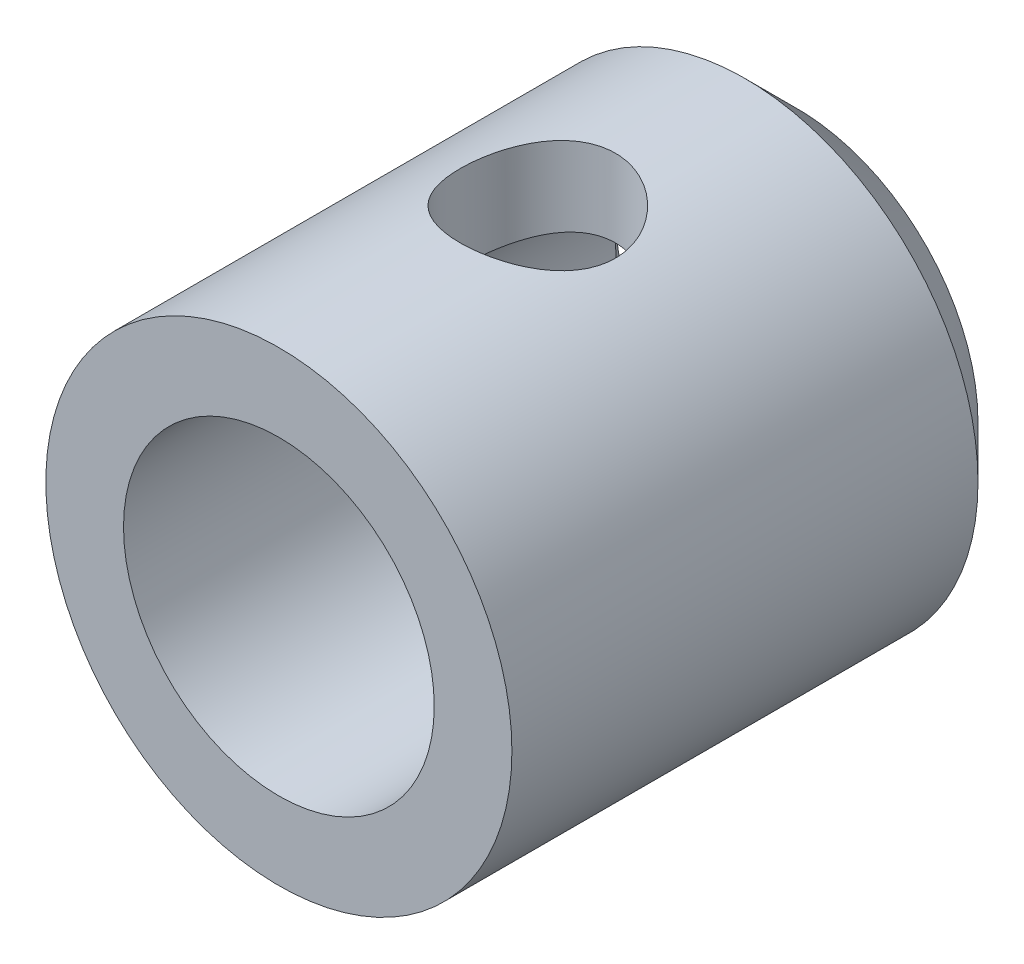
ISO-10303-21;
HEADER;
FILE_DESCRIPTION(('STEP AP214'),'2;1');
FILE_NAME('part.step','',(''),(''),'','','');
FILE_SCHEMA(('AUTOMOTIVE_DESIGN { 1 0 10303 214 1 1 1 1 }'));
ENDSEC;
DATA;
#1=APPLICATION_CONTEXT('core data for automotive mechanical design processes');
#2=APPLICATION_PROTOCOL_DEFINITION('international standard','automotive_design',2000,#1);
#3=PRODUCT_CONTEXT('',#1,'mechanical');
#4=PRODUCT('Part','Part','',(#3));
#5=PRODUCT_RELATED_PRODUCT_CATEGORY('part','',(#4));
#6=PRODUCT_DEFINITION_FORMATION('','',#4);
#7=PRODUCT_DEFINITION_CONTEXT('part definition',#1,'design');
#8=PRODUCT_DEFINITION('design','',#6,#7);
#9=PRODUCT_DEFINITION_SHAPE('','',#8);
#10=(LENGTH_UNIT() NAMED_UNIT(*) SI_UNIT(.MILLI.,.METRE.));
#11=(NAMED_UNIT(*) PLANE_ANGLE_UNIT() SI_UNIT($,.RADIAN.));
#12=(NAMED_UNIT(*) SI_UNIT($,.STERADIAN.) SOLID_ANGLE_UNIT());
#13=UNCERTAINTY_MEASURE_WITH_UNIT(LENGTH_MEASURE(1.E-05),#10,'distance_accuracy_value','');
#14=(GEOMETRIC_REPRESENTATION_CONTEXT(3) GLOBAL_UNCERTAINTY_ASSIGNED_CONTEXT((#13)) GLOBAL_UNIT_ASSIGNED_CONTEXT((#10,
#11,#12)) REPRESENTATION_CONTEXT('',''));
#15=CARTESIAN_POINT('',(0.,0.,0.));
#16=DIRECTION('',(0.,0.,1.));
#17=DIRECTION('',(1.,0.,0.));
#18=AXIS2_PLACEMENT_3D('',#15,#16,#17);
#19=CARTESIAN_POINT('',(0.,0.,20.));
#20=DIRECTION('',(0.,0.,1.));
#21=DIRECTION('',(1.,0.,0.));
#22=AXIS2_PLACEMENT_3D('',#19,#20,#21);
#23=PLANE('',#22);
#24=CARTESIAN_POINT('',(0.,0.,20.));
#25=DIRECTION('',(0.,0.,1.));
#26=DIRECTION('',(1.,0.,0.));
#27=AXIS2_PLACEMENT_3D('',#24,#25,#26);
#28=CIRCLE('',#27,9.);
#29=CARTESIAN_POINT('',(9.,0.,20.));
#30=VERTEX_POINT('',#29);
#31=EDGE_CURVE('E44',#30,#30,#28,.T.);
#32=ORIENTED_EDGE('',*,*,#31,.T.);
#33=EDGE_LOOP('',(#32));
#34=FACE_BOUND('',#33,.T.);
#35=CARTESIAN_POINT('',(0.,0.,20.));
#36=DIRECTION('',(0.,0.,1.));
#37=DIRECTION('',(1.,0.,0.));
#38=AXIS2_PLACEMENT_3D('',#35,#36,#37);
#39=CIRCLE('',#38,6.);
#40=CARTESIAN_POINT('',(6.,0.,20.));
#41=VERTEX_POINT('',#40);
#42=EDGE_CURVE('E82',#41,#41,#39,.T.);
#43=ORIENTED_EDGE('',*,*,#42,.F.);
#44=EDGE_LOOP('',(#43));
#45=FACE_BOUND('',#44,.T.);
#46=ADVANCED_FACE('F27',(#34,#45),#23,.T.);
#47=CARTESIAN_POINT('',(0.,0.,20.));
#48=DIRECTION('',(0.,0.,-1.));
#49=DIRECTION('',(-1.,0.,0.));
#50=AXIS2_PLACEMENT_3D('',#47,#48,#49);
#51=CYLINDRICAL_SURFACE('',#50,9.);
#52=CARTESIAN_POINT('',(0.,9.,12.9999999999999));
#53=CARTESIAN_POINT('',(-0.16369008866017,9.00000045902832,13.0000007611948));
#54=CARTESIAN_POINT('',(-0.32737558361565,8.99549308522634,12.9865592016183));
#55=CARTESIAN_POINT('',(-0.649925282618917,8.97795630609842,12.9333126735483));
#56=CARTESIAN_POINT('',(-0.808788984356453,8.96492601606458,12.8935049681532));
#57=CARTESIAN_POINT('',(-1.11699836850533,8.93175923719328,12.7890422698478));
#58=CARTESIAN_POINT('',(-1.2663594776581,8.9116346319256,12.7244288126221));
#59=CARTESIAN_POINT('',(-1.55212481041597,8.86633337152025,12.5723764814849));
#60=CARTESIAN_POINT('',(-1.68852647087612,8.84115572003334,12.4849331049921));
#61=CARTESIAN_POINT('',(-1.9492250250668,8.78742283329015,12.2865225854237));
#62=CARTESIAN_POINT('',(-2.07301110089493,8.75878669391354,12.1749062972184));
#63=CARTESIAN_POINT('',(-2.30049807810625,8.70180944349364,11.9326985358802));
#64=CARTESIAN_POINT('',(-2.40419455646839,8.67346839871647,11.8021028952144));
#65=CARTESIAN_POINT('',(-2.59147482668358,8.61939997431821,11.5210446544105));
#66=CARTESIAN_POINT('',(-2.6743945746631,8.59377117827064,11.3701187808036));
#67=CARTESIAN_POINT('',(-2.81345662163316,8.54925916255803,11.0554717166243));
#68=CARTESIAN_POINT('',(-2.86960709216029,8.53037388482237,10.8917544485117));
#69=CARTESIAN_POINT('',(-2.95162038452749,8.50233909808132,10.5619803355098));
#70=CARTESIAN_POINT('',(-2.97844034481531,8.49288287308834,10.3961883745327));
#71=CARTESIAN_POINT('',(-3.00402337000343,8.48386969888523,10.0622087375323));
#72=CARTESIAN_POINT('',(-3.00279510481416,8.4843096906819,9.89402181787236));
#73=CARTESIAN_POINT('',(-2.97305971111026,8.4947704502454,9.56819010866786));
#74=CARTESIAN_POINT('',(-2.94580173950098,8.50435247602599,9.41041479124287));
#75=CARTESIAN_POINT('',(-2.86681848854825,8.53129973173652,9.10181974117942));
#76=CARTESIAN_POINT('',(-2.81509027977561,8.54866589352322,8.95100084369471));
#77=CARTESIAN_POINT('',(-2.68781717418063,8.58953733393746,8.65776175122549));
#78=CARTESIAN_POINT('',(-2.61190214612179,8.61313697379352,8.51551592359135));
#79=CARTESIAN_POINT('',(-2.43866731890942,8.66377675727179,8.24538727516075));
#80=CARTESIAN_POINT('',(-2.34134133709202,8.69081789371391,8.11750861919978));
#81=CARTESIAN_POINT('',(-2.12204799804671,8.74701987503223,7.87272520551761));
#82=CARTESIAN_POINT('',(-1.99905945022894,8.77621768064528,7.75674191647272));
#83=CARTESIAN_POINT('',(-1.73501870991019,8.8322081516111,7.54680620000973));
#84=CARTESIAN_POINT('',(-1.59396478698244,8.85900058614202,7.45285588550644));
#85=CARTESIAN_POINT('',(-1.2958428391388,8.90751323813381,7.28891109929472));
#86=CARTESIAN_POINT('',(-1.13862982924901,8.92918050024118,7.21916352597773));
#87=CARTESIAN_POINT('',(-0.813807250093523,8.96461701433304,7.10739047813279));
#88=CARTESIAN_POINT('',(-0.646201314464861,8.97838900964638,7.06535537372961));
#89=CARTESIAN_POINT('',(-0.313151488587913,8.99602881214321,7.01183300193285));
#90=CARTESIAN_POINT('',(-0.147928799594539,9.00030005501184,6.99910057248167));
#91=CARTESIAN_POINT('',(0.182325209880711,8.99966708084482,7.00099802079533));
#92=CARTESIAN_POINT('',(0.347356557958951,8.99476441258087,7.01562327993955));
#93=CARTESIAN_POINT('',(0.667559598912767,8.97660074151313,7.0708357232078));
#94=CARTESIAN_POINT('',(0.82287842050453,8.96358596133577,7.11065861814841));
#95=CARTESIAN_POINT('',(1.12456787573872,8.9307554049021,7.21418033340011));
#96=CARTESIAN_POINT('',(1.27093736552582,8.91093876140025,7.27788219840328));
#97=CARTESIAN_POINT('',(1.55486488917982,8.86586793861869,7.42921129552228));
#98=CARTESIAN_POINT('',(1.69208987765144,8.84048444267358,7.51742377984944));
#99=CARTESIAN_POINT('',(1.95019449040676,8.78715761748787,7.71458245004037));
#100=CARTESIAN_POINT('',(2.07106910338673,8.75921350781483,7.82353496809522));
#101=CARTESIAN_POINT('',(2.2987575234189,8.70230543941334,8.06493625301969));
#102=CARTESIAN_POINT('',(2.40468290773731,8.67335283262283,8.19822768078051));
#103=CARTESIAN_POINT('',(2.59277256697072,8.61899919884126,8.48131470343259));
#104=CARTESIAN_POINT('',(2.67493664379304,8.59359820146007,8.63111043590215));
#105=CARTESIAN_POINT('',(2.81279079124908,8.54947175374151,8.94301904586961));
#106=CARTESIAN_POINT('',(2.86853439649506,8.53073282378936,9.10510623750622));
#107=CARTESIAN_POINT('',(2.95168400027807,8.50232496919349,9.43713595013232));
#108=CARTESIAN_POINT('',(2.97910276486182,8.49265195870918,9.60707489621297));
#109=CARTESIAN_POINT('',(3.00382884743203,8.48393576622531,9.94059128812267));
#110=CARTESIAN_POINT('',(3.0026107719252,8.48437200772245,10.1040470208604));
#111=CARTESIAN_POINT('',(2.97372688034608,8.49453809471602,10.4282952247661));
#112=CARTESIAN_POINT('',(2.94606263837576,8.50426738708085,10.5890878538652));
#113=CARTESIAN_POINT('',(2.86611543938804,8.53153572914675,10.9004069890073));
#114=CARTESIAN_POINT('',(2.81431003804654,8.54892294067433,11.0510704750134));
#115=CARTESIAN_POINT('',(2.68793809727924,8.58949196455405,11.3416822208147));
#116=CARTESIAN_POINT('',(2.61336650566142,8.61267506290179,11.4816280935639));
#117=CARTESIAN_POINT('',(2.43978207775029,8.66348487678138,11.7534510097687));
#118=CARTESIAN_POINT('',(2.33984472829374,8.69126134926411,11.8847095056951));
#119=CARTESIAN_POINT('',(2.11992864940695,8.74750068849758,12.1290694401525));
#120=CARTESIAN_POINT('',(1.99994425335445,8.77596374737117,12.2421657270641));
#121=CARTESIAN_POINT('',(1.73772467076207,8.83170091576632,12.4514332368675));
#122=CARTESIAN_POINT('',(1.59480454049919,8.8588854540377,12.5467730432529));
#123=CARTESIAN_POINT('',(1.29407207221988,8.90777973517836,12.7119712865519));
#124=CARTESIAN_POINT('',(1.13626355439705,8.9294908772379,12.7818362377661));
#125=CARTESIAN_POINT('',(0.817480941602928,8.96416545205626,12.8911648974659));
#126=CARTESIAN_POINT('',(0.656963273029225,8.97747637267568,12.9318473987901));
#127=CARTESIAN_POINT('',(0.33096124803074,8.99539221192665,12.9862608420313));
#128=CARTESIAN_POINT('',(0.165478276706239,8.99999953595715,12.9999992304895));
#129=CARTESIAN_POINT('',(0.,9.,12.9999999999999));
#130=B_SPLINE_CURVE_WITH_KNOTS('',3,(#52,#53,#54,#55,#56,#57,#58,#59,#60,#61,#62,#63,#64,#65,
#66,#67,#68,#69,#70,#71,#72,#73,#74,#75,#76,#77,#78,#79,#80,#81,#82,#83,#84,#85,#86,#87,#88,#89,
#90,#91,#92,#93,#94,#95,#96,#97,#98,#99,#100,#101,#102,#103,#104,#105,#106,#107,#108,#109,#110,
#111,#112,#113,#114,#115,#116,#117,#118,#119,#120,#121,#122,#123,#124,#125,#126,#127,#128,#129),
.UNSPECIFIED.,.T.,.F.,(4,2,2,2,2,2,2,2,2,2,2,2,2,2,2,2,2,2,2,2,2,2,2,2,2,2,2,2,2,2,2,2,2,2,2,2,
2,2,4),(0.,0.490461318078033,0.980973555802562,1.47066801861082,1.9604591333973,
2.46554052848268,2.97073299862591,3.49045154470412,4.010011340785,4.5120577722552,
5.01394901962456,5.49290479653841,5.97191792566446,6.45864513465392,6.94551307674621,
7.45779917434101,7.97013437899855,8.48755216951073,9.00479006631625,9.49960749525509,
9.9943413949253,10.4747447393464,10.9552093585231,11.4483119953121,11.9415654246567,
12.4572306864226,12.9729002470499,13.4875204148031,14.0019085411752,14.4898699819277,
14.9778023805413,15.4564676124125,15.9352391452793,16.4349020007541,16.9347063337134,
17.453989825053,17.9731404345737,18.4690967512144,18.9649159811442),.UNSPECIFIED.);
#131=CARTESIAN_POINT('',(0.,9.,12.9999999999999));
#132=VERTEX_POINT('',#131);
#133=EDGE_CURVE('E73',#132,#132,#130,.T.);
#134=ORIENTED_EDGE('',*,*,#133,.T.);
#135=EDGE_LOOP('',(#134));
#136=FACE_BOUND('',#135,.T.);
#137=CARTESIAN_POINT('',(0.,-9.,12.9999999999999));
#138=CARTESIAN_POINT('',(0.16369008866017,-9.00000045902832,13.0000007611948));
#139=CARTESIAN_POINT('',(0.32737558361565,-8.99549308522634,12.9865592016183));
#140=CARTESIAN_POINT('',(0.649925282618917,-8.97795630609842,12.9333126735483));
#141=CARTESIAN_POINT('',(0.808788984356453,-8.96492601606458,12.8935049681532));
#142=CARTESIAN_POINT('',(1.11699836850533,-8.93175923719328,12.7890422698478));
#143=CARTESIAN_POINT('',(1.2663594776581,-8.9116346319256,12.7244288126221));
#144=CARTESIAN_POINT('',(1.55212481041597,-8.86633337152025,12.5723764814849));
#145=CARTESIAN_POINT('',(1.68852647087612,-8.84115572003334,12.4849331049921));
#146=CARTESIAN_POINT('',(1.9492250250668,-8.78742283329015,12.2865225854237));
#147=CARTESIAN_POINT('',(2.07301110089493,-8.75878669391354,12.1749062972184));
#148=CARTESIAN_POINT('',(2.30049807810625,-8.70180944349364,11.9326985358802));
#149=CARTESIAN_POINT('',(2.40419455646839,-8.67346839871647,11.8021028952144));
#150=CARTESIAN_POINT('',(2.59147482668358,-8.61939997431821,11.5210446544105));
#151=CARTESIAN_POINT('',(2.6743945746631,-8.59377117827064,11.3701187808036));
#152=CARTESIAN_POINT('',(2.81345662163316,-8.54925916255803,11.0554717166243));
#153=CARTESIAN_POINT('',(2.86960709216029,-8.53037388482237,10.8917544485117));
#154=CARTESIAN_POINT('',(2.95162038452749,-8.50233909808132,10.5619803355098));
#155=CARTESIAN_POINT('',(2.97844034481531,-8.49288287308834,10.3961883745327));
#156=CARTESIAN_POINT('',(3.00402337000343,-8.48386969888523,10.0622087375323));
#157=CARTESIAN_POINT('',(3.00279510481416,-8.4843096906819,9.89402181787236));
#158=CARTESIAN_POINT('',(2.97305971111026,-8.4947704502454,9.56819010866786));
#159=CARTESIAN_POINT('',(2.94580173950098,-8.50435247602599,9.41041479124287));
#160=CARTESIAN_POINT('',(2.86681848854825,-8.53129973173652,9.10181974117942));
#161=CARTESIAN_POINT('',(2.81509027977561,-8.54866589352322,8.95100084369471));
#162=CARTESIAN_POINT('',(2.68781717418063,-8.58953733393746,8.65776175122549));
#163=CARTESIAN_POINT('',(2.61190214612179,-8.61313697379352,8.51551592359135));
#164=CARTESIAN_POINT('',(2.43866731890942,-8.66377675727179,8.24538727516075));
#165=CARTESIAN_POINT('',(2.34134133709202,-8.69081789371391,8.11750861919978));
#166=CARTESIAN_POINT('',(2.12204799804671,-8.74701987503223,7.87272520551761));
#167=CARTESIAN_POINT('',(1.99905945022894,-8.77621768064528,7.75674191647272));
#168=CARTESIAN_POINT('',(1.73501870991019,-8.8322081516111,7.54680620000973));
#169=CARTESIAN_POINT('',(1.59396478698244,-8.85900058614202,7.45285588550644));
#170=CARTESIAN_POINT('',(1.2958428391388,-8.90751323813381,7.28891109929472));
#171=CARTESIAN_POINT('',(1.13862982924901,-8.92918050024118,7.21916352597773));
#172=CARTESIAN_POINT('',(0.813807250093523,-8.96461701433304,7.10739047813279));
#173=CARTESIAN_POINT('',(0.646201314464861,-8.97838900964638,7.06535537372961));
#174=CARTESIAN_POINT('',(0.313151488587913,-8.99602881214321,7.01183300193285));
#175=CARTESIAN_POINT('',(0.147928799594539,-9.00030005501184,6.99910057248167));
#176=CARTESIAN_POINT('',(-0.182325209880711,-8.99966708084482,7.00099802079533));
#177=CARTESIAN_POINT('',(-0.347356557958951,-8.99476441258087,7.01562327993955));
#178=CARTESIAN_POINT('',(-0.667559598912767,-8.97660074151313,7.0708357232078));
#179=CARTESIAN_POINT('',(-0.82287842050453,-8.96358596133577,7.11065861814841));
#180=CARTESIAN_POINT('',(-1.12456787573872,-8.9307554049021,7.21418033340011));
#181=CARTESIAN_POINT('',(-1.27093736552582,-8.91093876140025,7.27788219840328));
#182=CARTESIAN_POINT('',(-1.55486488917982,-8.86586793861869,7.42921129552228));
#183=CARTESIAN_POINT('',(-1.69208987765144,-8.84048444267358,7.51742377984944));
#184=CARTESIAN_POINT('',(-1.95019449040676,-8.78715761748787,7.71458245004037));
#185=CARTESIAN_POINT('',(-2.07106910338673,-8.75921350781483,7.82353496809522));
#186=CARTESIAN_POINT('',(-2.2987575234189,-8.70230543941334,8.06493625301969));
#187=CARTESIAN_POINT('',(-2.40468290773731,-8.67335283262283,8.19822768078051));
#188=CARTESIAN_POINT('',(-2.59277256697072,-8.61899919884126,8.48131470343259));
#189=CARTESIAN_POINT('',(-2.67493664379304,-8.59359820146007,8.63111043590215));
#190=CARTESIAN_POINT('',(-2.81279079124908,-8.54947175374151,8.94301904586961));
#191=CARTESIAN_POINT('',(-2.86853439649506,-8.53073282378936,9.10510623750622));
#192=CARTESIAN_POINT('',(-2.95168400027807,-8.50232496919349,9.43713595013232));
#193=CARTESIAN_POINT('',(-2.97910276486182,-8.49265195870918,9.60707489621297));
#194=CARTESIAN_POINT('',(-3.00382884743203,-8.48393576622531,9.94059128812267));
#195=CARTESIAN_POINT('',(-3.0026107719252,-8.48437200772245,10.1040470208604));
#196=CARTESIAN_POINT('',(-2.97372688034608,-8.49453809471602,10.4282952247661));
#197=CARTESIAN_POINT('',(-2.94606263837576,-8.50426738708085,10.5890878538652));
#198=CARTESIAN_POINT('',(-2.86611543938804,-8.53153572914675,10.9004069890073));
#199=CARTESIAN_POINT('',(-2.81431003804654,-8.54892294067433,11.0510704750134));
#200=CARTESIAN_POINT('',(-2.68793809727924,-8.58949196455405,11.3416822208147));
#201=CARTESIAN_POINT('',(-2.61336650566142,-8.61267506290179,11.4816280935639));
#202=CARTESIAN_POINT('',(-2.43978207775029,-8.66348487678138,11.7534510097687));
#203=CARTESIAN_POINT('',(-2.33984472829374,-8.69126134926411,11.8847095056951));
#204=CARTESIAN_POINT('',(-2.11992864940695,-8.74750068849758,12.1290694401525));
#205=CARTESIAN_POINT('',(-1.99994425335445,-8.77596374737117,12.2421657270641));
#206=CARTESIAN_POINT('',(-1.73772467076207,-8.83170091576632,12.4514332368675));
#207=CARTESIAN_POINT('',(-1.59480454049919,-8.8588854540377,12.5467730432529));
#208=CARTESIAN_POINT('',(-1.29407207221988,-8.90777973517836,12.7119712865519));
#209=CARTESIAN_POINT('',(-1.13626355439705,-8.9294908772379,12.7818362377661));
#210=CARTESIAN_POINT('',(-0.817480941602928,-8.96416545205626,12.8911648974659));
#211=CARTESIAN_POINT('',(-0.656963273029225,-8.97747637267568,12.9318473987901));
#212=CARTESIAN_POINT('',(-0.33096124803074,-8.99539221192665,12.9862608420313));
#213=CARTESIAN_POINT('',(-0.165478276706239,-8.99999953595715,12.9999992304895));
#214=CARTESIAN_POINT('',(0.,-9.,12.9999999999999));
#215=B_SPLINE_CURVE_WITH_KNOTS('',3,(#137,#138,#139,#140,#141,#142,#143,#144,#145,#146,#147,
#148,#149,#150,#151,#152,#153,#154,#155,#156,#157,#158,#159,#160,#161,#162,#163,#164,#165,#166,
#167,#168,#169,#170,#171,#172,#173,#174,#175,#176,#177,#178,#179,#180,#181,#182,#183,#184,#185,
#186,#187,#188,#189,#190,#191,#192,#193,#194,#195,#196,#197,#198,#199,#200,#201,#202,#203,#204,
#205,#206,#207,#208,#209,#210,#211,#212,#213,#214),.UNSPECIFIED.,.T.,.F.,(4,2,2,2,2,2,2,2,2,2,2,
2,2,2,2,2,2,2,2,2,2,2,2,2,2,2,2,2,2,2,2,2,2,2,2,2,2,2,4),(0.,0.490461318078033,
0.980973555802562,1.47066801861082,1.9604591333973,2.46554052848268,2.97073299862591,
3.49045154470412,4.010011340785,4.5120577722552,5.01394901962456,5.49290479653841,
5.97191792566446,6.45864513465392,6.94551307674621,7.45779917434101,7.97013437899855,
8.48755216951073,9.00479006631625,9.49960749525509,9.9943413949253,10.4747447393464,
10.9552093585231,11.4483119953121,11.9415654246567,12.4572306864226,12.9729002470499,
13.4875204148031,14.0019085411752,14.4898699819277,14.9778023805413,15.4564676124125,
15.9352391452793,16.4349020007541,16.9347063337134,17.453989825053,17.9731404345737,
18.4690967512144,18.9649159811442),.UNSPECIFIED.);
#216=CARTESIAN_POINT('',(0.,-9.,12.9999999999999));
#217=VERTEX_POINT('',#216);
#218=EDGE_CURVE('E77',#217,#217,#215,.T.);
#219=ORIENTED_EDGE('',*,*,#218,.T.);
#220=EDGE_LOOP('',(#219));
#221=FACE_BOUND('',#220,.T.);
#222=CARTESIAN_POINT('',(0.,0.,2.00000000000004));
#223=DIRECTION('',(0.,0.,1.));
#224=DIRECTION('',(1.,0.,0.));
#225=AXIS2_PLACEMENT_3D('',#222,#223,#224);
#226=CIRCLE('',#225,9.);
#227=CARTESIAN_POINT('',(9.,0.,2.00000000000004));
#228=VERTEX_POINT('',#227);
#229=EDGE_CURVE('E39',#228,#228,#226,.T.);
#230=ORIENTED_EDGE('',*,*,#229,.T.);
#231=EDGE_LOOP('',(#230));
#232=FACE_BOUND('',#231,.T.);
#233=ORIENTED_EDGE('',*,*,#31,.F.);
#234=EDGE_LOOP('',(#233));
#235=FACE_BOUND('',#234,.T.);
#236=ADVANCED_FACE('F29',(#136,#221,#232,#235),#51,.T.);
#237=CARTESIAN_POINT('',(0.,0.,20.));
#238=DIRECTION('',(0.,0.,-1.));
#239=DIRECTION('',(-1.,0.,0.));
#240=AXIS2_PLACEMENT_3D('',#237,#238,#239);
#241=CYLINDRICAL_SURFACE('',#240,6.);
#242=CARTESIAN_POINT('',(0.,0.,1.00000000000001));
#243=DIRECTION('',(0.,0.,1.));
#244=DIRECTION('',(1.,0.,0.));
#245=AXIS2_PLACEMENT_3D('',#242,#243,#244);
#246=CIRCLE('',#245,6.);
#247=CARTESIAN_POINT('',(6.,0.,1.00000000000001));
#248=VERTEX_POINT('',#247);
#249=EDGE_CURVE('E10',#248,#248,#246,.F.);
#250=ORIENTED_EDGE('',*,*,#249,.T.);
#251=EDGE_LOOP('',(#250));
#252=FACE_BOUND('',#251,.T.);
#253=CARTESIAN_POINT('',(0.,-6.,12.9999999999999));
#254=CARTESIAN_POINT('',(0.0788941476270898,-5.99999934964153,12.9999991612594));
#255=CARTESIAN_POINT('',(0.15779662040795,-5.99843869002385,12.9968820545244));
#256=CARTESIAN_POINT('',(0.315001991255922,-5.99224358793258,12.9844607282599));
#257=CARTESIAN_POINT('',(0.393304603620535,-5.98760776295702,12.9751537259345));
#258=CARTESIAN_POINT('',(0.626628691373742,-5.96921978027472,12.9380421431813));
#259=CARTESIAN_POINT('',(0.779952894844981,-5.95098734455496,12.9010471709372));
#260=CARTESIAN_POINT('',(1.07683586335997,-5.90448966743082,12.8044182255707));
#261=CARTESIAN_POINT('',(1.22043005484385,-5.87626344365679,12.7448722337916));
#262=CARTESIAN_POINT('',(1.49540820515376,-5.81237302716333,12.6052887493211));
#263=CARTESIAN_POINT('',(1.62679312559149,-5.77670942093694,12.5252528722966));
#264=CARTESIAN_POINT('',(1.88252701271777,-5.69868752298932,12.3414460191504));
#265=CARTESIAN_POINT('',(2.0059694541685,-5.65605474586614,12.2365320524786));
#266=CARTESIAN_POINT('',(2.23433451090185,-5.56980033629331,12.0084440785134));
#267=CARTESIAN_POINT('',(2.33924301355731,-5.5261779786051,11.8852562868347));
#268=CARTESIAN_POINT('',(2.53576864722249,-5.43896347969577,11.6125156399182));
#269=CARTESIAN_POINT('',(2.62572411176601,-5.39563602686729,11.4616590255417));
#270=CARTESIAN_POINT('',(2.7403403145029,-5.33782449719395,11.2240491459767));
#271=CARTESIAN_POINT('',(2.77516786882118,-5.31974570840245,11.1429290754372));
#272=CARTESIAN_POINT('',(2.83769299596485,-5.28665768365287,10.9773994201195));
#273=CARTESIAN_POINT('',(2.86539478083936,-5.27164663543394,10.8929918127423));
#274=CARTESIAN_POINT('',(2.91188280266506,-5.24610341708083,10.7266042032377));
#275=CARTESIAN_POINT('',(2.93110042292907,-5.23535838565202,10.6447772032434));
#276=CARTESIAN_POINT('',(2.9626355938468,-5.21757784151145,10.4794450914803));
#277=CARTESIAN_POINT('',(2.9749568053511,-5.21054036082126,10.3959408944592));
#278=CARTESIAN_POINT('',(2.99251382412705,-5.20047756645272,10.2279936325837));
#279=CARTESIAN_POINT('',(2.99775389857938,-5.19744983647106,10.1435511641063));
#280=CARTESIAN_POINT('',(3.00108452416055,-5.19552555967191,9.97450634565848));
#281=CARTESIAN_POINT('',(2.9991757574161,-5.19662861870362,9.88990401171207));
#282=CARTESIAN_POINT('',(2.98404973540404,-5.20534668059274,9.65724610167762));
#283=CARTESIAN_POINT('',(2.96335042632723,-5.21726794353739,9.50975584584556));
#284=CARTESIAN_POINT('',(2.90082280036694,-5.25228182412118,9.22080632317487));
#285=CARTESIAN_POINT('',(2.85898775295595,-5.2753780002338,9.07934899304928));
#286=CARTESIAN_POINT('',(2.75462843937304,-5.33062568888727,8.80232034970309));
#287=CARTESIAN_POINT('',(2.69164495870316,-5.36297559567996,8.66696288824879));
#288=CARTESIAN_POINT('',(2.54712530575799,-5.43310175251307,8.40809503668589));
#289=CARTESIAN_POINT('',(2.46558080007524,-5.47088043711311,8.28459000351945));
#290=CARTESIAN_POINT('',(2.27419808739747,-5.55339485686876,8.03643690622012));
#291=CARTESIAN_POINT('',(2.16208335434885,-5.59840533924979,7.91362955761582));
#292=CARTESIAN_POINT('',(1.91866675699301,-5.68642866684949,7.68779356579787));
#293=CARTESIAN_POINT('',(1.78735577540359,-5.72944054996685,7.58477437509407));
#294=CARTESIAN_POINT('',(1.50154951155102,-5.81105962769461,7.39694306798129));
#295=CARTESIAN_POINT('',(1.3462607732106,-5.84936952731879,7.31319859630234));
#296=CARTESIAN_POINT('',(1.02139864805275,-5.91473643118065,7.17370889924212));
#297=CARTESIAN_POINT('',(0.851836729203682,-5.94180236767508,7.11794144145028));
#298=CARTESIAN_POINT('',(0.518299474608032,-5.97973001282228,7.04057379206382));
#299=CARTESIAN_POINT('',(0.355024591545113,-5.99174814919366,7.01652629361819));
#300=CARTESIAN_POINT('',(0.0263387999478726,-6.00219040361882,6.99560580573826));
#301=CARTESIAN_POINT('',(-0.13907105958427,-6.00062096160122,6.99871994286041));
#302=CARTESIAN_POINT('',(-0.453698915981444,-5.98473576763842,7.03062006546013));
#303=CARTESIAN_POINT('',(-0.60317822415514,-5.97141737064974,7.05739759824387));
#304=CARTESIAN_POINT('',(-0.895220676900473,-5.93466513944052,7.13271421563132));
#305=CARTESIAN_POINT('',(-1.03778305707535,-5.91123019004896,7.18125569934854));
#306=CARTESIAN_POINT('',(-1.31666582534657,-5.85552754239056,7.29999539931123));
#307=CARTESIAN_POINT('',(-1.45269119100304,-5.82302645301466,7.37077315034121));
#308=CARTESIAN_POINT('',(-1.71138408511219,-5.75231922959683,7.53132260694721));
#309=CARTESIAN_POINT('',(-1.83404588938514,-5.71411066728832,7.62110240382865));
#310=CARTESIAN_POINT('',(-2.07530306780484,-5.63124663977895,7.82728127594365));
#311=CARTESIAN_POINT('',(-2.19231623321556,-5.58632654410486,7.94542860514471));
#312=CARTESIAN_POINT('',(-2.40556896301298,-5.49787174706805,8.19977545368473));
#313=CARTESIAN_POINT('',(-2.50179415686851,-5.4543380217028,8.33598735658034));
#314=CARTESIAN_POINT('',(-2.675123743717,-5.3715357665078,8.63093096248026));
#315=CARTESIAN_POINT('',(-2.75107648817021,-5.33257588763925,8.79043379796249));
#316=CARTESIAN_POINT('',(-2.87424847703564,-5.26722216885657,9.12253020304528));
#317=CARTESIAN_POINT('',(-2.92150474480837,-5.24081214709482,9.29510658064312));
#318=CARTESIAN_POINT('',(-2.98158506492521,-5.2068450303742,9.63073066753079));
#319=CARTESIAN_POINT('',(-2.997278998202,-5.19772150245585,9.7931027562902));
#320=CARTESIAN_POINT('',(-3.00206745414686,-5.19496064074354,10.1183412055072));
#321=CARTESIAN_POINT('',(-2.99117350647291,-5.20131659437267,10.2812073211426));
#322=CARTESIAN_POINT('',(-2.94577840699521,-5.227135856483,10.5864504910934));
#323=CARTESIAN_POINT('',(-2.91362505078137,-5.24529281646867,10.7293013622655));
#324=CARTESIAN_POINT('',(-2.82952596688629,-5.29113050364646,11.0074244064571));
#325=CARTESIAN_POINT('',(-2.77757387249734,-5.3188142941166,11.1426941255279));
#326=CARTESIAN_POINT('',(-2.65144766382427,-5.38285583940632,11.4118743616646));
#327=CARTESIAN_POINT('',(-2.57601505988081,-5.41967139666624,11.5450829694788));
#328=CARTESIAN_POINT('',(-2.40645126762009,-5.49706022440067,11.7978243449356));
#329=CARTESIAN_POINT('',(-2.31231035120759,-5.53763544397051,11.9173499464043));
#330=CARTESIAN_POINT('',(-2.09461689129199,-5.62386853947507,12.154422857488));
#331=CARTESIAN_POINT('',(-1.96888052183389,-5.66954494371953,12.2699651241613));
#332=CARTESIAN_POINT('',(-1.69843715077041,-5.75633712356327,12.4788011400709));
#333=CARTESIAN_POINT('',(-1.55371998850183,-5.79745043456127,12.5720828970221));
#334=CARTESIAN_POINT('',(-1.32452333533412,-5.85251406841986,12.6931781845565));
#335=CARTESIAN_POINT('',(-1.24575314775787,-5.86982524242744,12.7305202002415));
#336=CARTESIAN_POINT('',(-1.08479725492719,-5.90168845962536,12.7983616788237));
#337=CARTESIAN_POINT('',(-1.00261324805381,-5.91624185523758,12.8288644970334));
#338=CARTESIAN_POINT('',(-0.835616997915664,-5.94212690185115,12.8826072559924));
#339=CARTESIAN_POINT('',(-0.750810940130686,-5.95346557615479,12.9058630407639));
#340=CARTESIAN_POINT('',(-0.579142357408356,-5.97260771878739,12.9448825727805));
#341=CARTESIAN_POINT('',(-0.49228112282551,-5.98041334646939,12.9606508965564));
#342=CARTESIAN_POINT('',(-0.337824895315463,-5.99085829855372,12.9816846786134));
#343=CARTESIAN_POINT('',(-0.27049516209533,-5.99428035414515,12.9885469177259));
#344=CARTESIAN_POINT('',(-0.135445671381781,-5.99885151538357,12.997705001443));
#345=CARTESIAN_POINT('',(-0.0677259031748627,-6.00000055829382,13.0000007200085));
#346=CARTESIAN_POINT('',(0.,-6.,12.9999999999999));
#347=B_SPLINE_CURVE_WITH_KNOTS('',3,(#253,#254,#255,#256,#257,#258,#259,#260,#261,#262,#263,
#264,#265,#266,#267,#268,#269,#270,#271,#272,#273,#274,#275,#276,#277,#278,#279,#280,#281,#282,
#283,#284,#285,#286,#287,#288,#289,#290,#291,#292,#293,#294,#295,#296,#297,#298,#299,#300,#301,
#302,#303,#304,#305,#306,#307,#308,#309,#310,#311,#312,#313,#314,#315,#316,#317,#318,#319,#320,
#321,#322,#323,#324,#325,#326,#327,#328,#329,#330,#331,#332,#333,#334,#335,#336,#337,#338,#339,
#340,#341,#342,#343,#344,#345,#346),.UNSPECIFIED.,.T.,.F.,(4,2,2,2,2,2,2,2,2,2,2,2,2,2,2,2,2,2,
2,2,2,2,2,2,2,2,2,2,2,2,2,2,2,2,2,2,2,2,2,2,2,2,2,2,2,2,4),(0.,0.236611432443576,
0.4733293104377,0.947100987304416,1.41904300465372,1.89094781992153,2.39140181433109,
2.89223525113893,3.43190833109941,3.70192714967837,3.97178599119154,4.2256372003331,
4.47935352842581,4.73291689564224,4.98645606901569,5.43238672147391,5.87845946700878,
6.33492255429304,6.79159098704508,7.30616358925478,7.82098138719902,8.35970601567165,
8.89800185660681,9.3917140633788,9.88519228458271,10.3404225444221,10.7957029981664,
11.2640010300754,11.7324988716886,12.2470036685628,12.7618630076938,13.3016558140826,
13.8407507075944,14.3280945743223,14.8152271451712,15.2559532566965,15.6968212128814,
16.1673090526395,16.6380421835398,17.1659726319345,17.6941868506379,17.9605054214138,
18.2266930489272,18.4922945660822,18.7577335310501,18.9608446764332,19.1639614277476),.UNSPECIFIED.);
#348=CARTESIAN_POINT('',(0.,-6.,12.9999999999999));
#349=VERTEX_POINT('',#348);
#350=EDGE_CURVE('E54',#349,#349,#347,.T.);
#351=ORIENTED_EDGE('',*,*,#350,.F.);
#352=EDGE_LOOP('',(#351));
#353=FACE_BOUND('',#352,.T.);
#354=CARTESIAN_POINT('',(0.,6.,12.9999999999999));
#355=CARTESIAN_POINT('',(-0.0788941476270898,5.99999934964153,12.9999991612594));
#356=CARTESIAN_POINT('',(-0.15779662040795,5.99843869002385,12.9968820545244));
#357=CARTESIAN_POINT('',(-0.315001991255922,5.99224358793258,12.9844607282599));
#358=CARTESIAN_POINT('',(-0.393304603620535,5.98760776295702,12.9751537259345));
#359=CARTESIAN_POINT('',(-0.626628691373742,5.96921978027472,12.9380421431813));
#360=CARTESIAN_POINT('',(-0.779952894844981,5.95098734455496,12.9010471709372));
#361=CARTESIAN_POINT('',(-1.07683586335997,5.90448966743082,12.8044182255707));
#362=CARTESIAN_POINT('',(-1.22043005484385,5.87626344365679,12.7448722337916));
#363=CARTESIAN_POINT('',(-1.49540820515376,5.81237302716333,12.6052887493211));
#364=CARTESIAN_POINT('',(-1.62679312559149,5.77670942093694,12.5252528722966));
#365=CARTESIAN_POINT('',(-1.88252701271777,5.69868752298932,12.3414460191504));
#366=CARTESIAN_POINT('',(-2.0059694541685,5.65605474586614,12.2365320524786));
#367=CARTESIAN_POINT('',(-2.23433451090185,5.56980033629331,12.0084440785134));
#368=CARTESIAN_POINT('',(-2.33924301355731,5.5261779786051,11.8852562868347));
#369=CARTESIAN_POINT('',(-2.53576864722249,5.43896347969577,11.6125156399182));
#370=CARTESIAN_POINT('',(-2.62572411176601,5.39563602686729,11.4616590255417));
#371=CARTESIAN_POINT('',(-2.7403403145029,5.33782449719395,11.2240491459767));
#372=CARTESIAN_POINT('',(-2.77516786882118,5.31974570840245,11.1429290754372));
#373=CARTESIAN_POINT('',(-2.83769299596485,5.28665768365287,10.9773994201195));
#374=CARTESIAN_POINT('',(-2.86539478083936,5.27164663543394,10.8929918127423));
#375=CARTESIAN_POINT('',(-2.91188280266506,5.24610341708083,10.7266042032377));
#376=CARTESIAN_POINT('',(-2.93110042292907,5.23535838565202,10.6447772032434));
#377=CARTESIAN_POINT('',(-2.9626355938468,5.21757784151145,10.4794450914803));
#378=CARTESIAN_POINT('',(-2.9749568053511,5.21054036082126,10.3959408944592));
#379=CARTESIAN_POINT('',(-2.99251382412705,5.20047756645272,10.2279936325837));
#380=CARTESIAN_POINT('',(-2.99775389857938,5.19744983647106,10.1435511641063));
#381=CARTESIAN_POINT('',(-3.00108452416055,5.19552555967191,9.97450634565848));
#382=CARTESIAN_POINT('',(-2.9991757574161,5.19662861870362,9.88990401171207));
#383=CARTESIAN_POINT('',(-2.98404973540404,5.20534668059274,9.65724610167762));
#384=CARTESIAN_POINT('',(-2.96335042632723,5.21726794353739,9.50975584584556));
#385=CARTESIAN_POINT('',(-2.90082280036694,5.25228182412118,9.22080632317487));
#386=CARTESIAN_POINT('',(-2.85898775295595,5.2753780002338,9.07934899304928));
#387=CARTESIAN_POINT('',(-2.75462843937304,5.33062568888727,8.80232034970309));
#388=CARTESIAN_POINT('',(-2.69164495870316,5.36297559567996,8.66696288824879));
#389=CARTESIAN_POINT('',(-2.54712530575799,5.43310175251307,8.40809503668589));
#390=CARTESIAN_POINT('',(-2.46558080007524,5.47088043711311,8.28459000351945));
#391=CARTESIAN_POINT('',(-2.27419808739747,5.55339485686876,8.03643690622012));
#392=CARTESIAN_POINT('',(-2.16208335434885,5.59840533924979,7.91362955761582));
#393=CARTESIAN_POINT('',(-1.91866675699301,5.68642866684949,7.68779356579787));
#394=CARTESIAN_POINT('',(-1.78735577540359,5.72944054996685,7.58477437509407));
#395=CARTESIAN_POINT('',(-1.50154951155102,5.81105962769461,7.39694306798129));
#396=CARTESIAN_POINT('',(-1.3462607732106,5.84936952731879,7.31319859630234));
#397=CARTESIAN_POINT('',(-1.02139864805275,5.91473643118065,7.17370889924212));
#398=CARTESIAN_POINT('',(-0.851836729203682,5.94180236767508,7.11794144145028));
#399=CARTESIAN_POINT('',(-0.518299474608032,5.97973001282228,7.04057379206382));
#400=CARTESIAN_POINT('',(-0.355024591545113,5.99174814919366,7.01652629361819));
#401=CARTESIAN_POINT('',(-0.0263387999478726,6.00219040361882,6.99560580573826));
#402=CARTESIAN_POINT('',(0.13907105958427,6.00062096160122,6.99871994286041));
#403=CARTESIAN_POINT('',(0.453698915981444,5.98473576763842,7.03062006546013));
#404=CARTESIAN_POINT('',(0.60317822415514,5.97141737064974,7.05739759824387));
#405=CARTESIAN_POINT('',(0.895220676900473,5.93466513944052,7.13271421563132));
#406=CARTESIAN_POINT('',(1.03778305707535,5.91123019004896,7.18125569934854));
#407=CARTESIAN_POINT('',(1.31666582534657,5.85552754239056,7.29999539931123));
#408=CARTESIAN_POINT('',(1.45269119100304,5.82302645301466,7.37077315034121));
#409=CARTESIAN_POINT('',(1.71138408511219,5.75231922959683,7.53132260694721));
#410=CARTESIAN_POINT('',(1.83404588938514,5.71411066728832,7.62110240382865));
#411=CARTESIAN_POINT('',(2.07530306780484,5.63124663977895,7.82728127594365));
#412=CARTESIAN_POINT('',(2.19231623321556,5.58632654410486,7.94542860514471));
#413=CARTESIAN_POINT('',(2.40556896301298,5.49787174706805,8.19977545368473));
#414=CARTESIAN_POINT('',(2.50179415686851,5.4543380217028,8.33598735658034));
#415=CARTESIAN_POINT('',(2.675123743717,5.3715357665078,8.63093096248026));
#416=CARTESIAN_POINT('',(2.75107648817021,5.33257588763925,8.79043379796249));
#417=CARTESIAN_POINT('',(2.87424847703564,5.26722216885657,9.12253020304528));
#418=CARTESIAN_POINT('',(2.92150474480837,5.24081214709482,9.29510658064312));
#419=CARTESIAN_POINT('',(2.98158506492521,5.2068450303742,9.63073066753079));
#420=CARTESIAN_POINT('',(2.997278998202,5.19772150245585,9.7931027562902));
#421=CARTESIAN_POINT('',(3.00206745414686,5.19496064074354,10.1183412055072));
#422=CARTESIAN_POINT('',(2.99117350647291,5.20131659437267,10.2812073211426));
#423=CARTESIAN_POINT('',(2.94577840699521,5.227135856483,10.5864504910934));
#424=CARTESIAN_POINT('',(2.91362505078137,5.24529281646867,10.7293013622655));
#425=CARTESIAN_POINT('',(2.82952596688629,5.29113050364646,11.0074244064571));
#426=CARTESIAN_POINT('',(2.77757387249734,5.3188142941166,11.1426941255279));
#427=CARTESIAN_POINT('',(2.65144766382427,5.38285583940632,11.4118743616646));
#428=CARTESIAN_POINT('',(2.57601505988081,5.41967139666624,11.5450829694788));
#429=CARTESIAN_POINT('',(2.40645126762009,5.49706022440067,11.7978243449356));
#430=CARTESIAN_POINT('',(2.31231035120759,5.53763544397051,11.9173499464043));
#431=CARTESIAN_POINT('',(2.09461689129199,5.62386853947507,12.154422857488));
#432=CARTESIAN_POINT('',(1.96888052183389,5.66954494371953,12.2699651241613));
#433=CARTESIAN_POINT('',(1.69843715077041,5.75633712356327,12.4788011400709));
#434=CARTESIAN_POINT('',(1.55371998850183,5.79745043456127,12.5720828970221));
#435=CARTESIAN_POINT('',(1.32452333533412,5.85251406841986,12.6931781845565));
#436=CARTESIAN_POINT('',(1.24575314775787,5.86982524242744,12.7305202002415));
#437=CARTESIAN_POINT('',(1.08479725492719,5.90168845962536,12.7983616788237));
#438=CARTESIAN_POINT('',(1.00261324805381,5.91624185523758,12.8288644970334));
#439=CARTESIAN_POINT('',(0.835616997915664,5.94212690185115,12.8826072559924));
#440=CARTESIAN_POINT('',(0.750810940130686,5.95346557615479,12.9058630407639));
#441=CARTESIAN_POINT('',(0.579142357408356,5.97260771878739,12.9448825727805));
#442=CARTESIAN_POINT('',(0.49228112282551,5.98041334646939,12.9606508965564));
#443=CARTESIAN_POINT('',(0.337824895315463,5.99085829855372,12.9816846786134));
#444=CARTESIAN_POINT('',(0.27049516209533,5.99428035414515,12.9885469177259));
#445=CARTESIAN_POINT('',(0.135445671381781,5.99885151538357,12.997705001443));
#446=CARTESIAN_POINT('',(0.0677259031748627,6.00000055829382,13.0000007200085));
#447=CARTESIAN_POINT('',(0.,6.,12.9999999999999));
#448=B_SPLINE_CURVE_WITH_KNOTS('',3,(#354,#355,#356,#357,#358,#359,#360,#361,#362,#363,#364,
#365,#366,#367,#368,#369,#370,#371,#372,#373,#374,#375,#376,#377,#378,#379,#380,#381,#382,#383,
#384,#385,#386,#387,#388,#389,#390,#391,#392,#393,#394,#395,#396,#397,#398,#399,#400,#401,#402,
#403,#404,#405,#406,#407,#408,#409,#410,#411,#412,#413,#414,#415,#416,#417,#418,#419,#420,#421,
#422,#423,#424,#425,#426,#427,#428,#429,#430,#431,#432,#433,#434,#435,#436,#437,#438,#439,#440,
#441,#442,#443,#444,#445,#446,#447),.UNSPECIFIED.,.T.,.F.,(4,2,2,2,2,2,2,2,2,2,2,2,2,2,2,2,2,2,
2,2,2,2,2,2,2,2,2,2,2,2,2,2,2,2,2,2,2,2,2,2,2,2,2,2,2,2,4),(0.,0.236611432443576,
0.4733293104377,0.947100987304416,1.41904300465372,1.89094781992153,2.39140181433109,
2.89223525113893,3.43190833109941,3.70192714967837,3.97178599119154,4.2256372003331,
4.47935352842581,4.73291689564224,4.98645606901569,5.43238672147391,5.87845946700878,
6.33492255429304,6.79159098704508,7.30616358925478,7.82098138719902,8.35970601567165,
8.89800185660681,9.3917140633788,9.88519228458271,10.3404225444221,10.7957029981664,
11.2640010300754,11.7324988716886,12.2470036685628,12.7618630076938,13.3016558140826,
13.8407507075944,14.3280945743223,14.8152271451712,15.2559532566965,15.6968212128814,
16.1673090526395,16.6380421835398,17.1659726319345,17.6941868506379,17.9605054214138,
18.2266930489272,18.4922945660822,18.7577335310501,18.9608446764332,19.1639614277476),.UNSPECIFIED.);
#449=CARTESIAN_POINT('',(0.,6.,12.9999999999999));
#450=VERTEX_POINT('',#449);
#451=EDGE_CURVE('E48',#450,#450,#448,.T.);
#452=ORIENTED_EDGE('',*,*,#451,.F.);
#453=EDGE_LOOP('',(#452));
#454=FACE_BOUND('',#453,.T.);
#455=ORIENTED_EDGE('',*,*,#42,.T.);
#456=EDGE_LOOP('',(#455));
#457=FACE_BOUND('',#456,.T.);
#458=ADVANCED_FACE('F57',(#252,#353,#454,#457),#241,.F.);
#459=CARTESIAN_POINT('',(0.,0.,2.00000000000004));
#460=DIRECTION('',(0.,0.,1.));
#461=DIRECTION('',(1.,0.,0.));
#462=AXIS2_PLACEMENT_3D('',#459,#460,#461);
#463=CONICAL_SURFACE('',#462,9.,0.785398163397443);
#464=CARTESIAN_POINT('',(0.,0.,0.));
#465=DIRECTION('',(0.,0.,1.));
#466=DIRECTION('',(1.,0.,0.));
#467=AXIS2_PLACEMENT_3D('',#464,#465,#466);
#468=CIRCLE('',#467,6.99999999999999);
#469=CARTESIAN_POINT('',(6.99999999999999,0.,0.));
#470=VERTEX_POINT('',#469);
#471=EDGE_CURVE('E35',#470,#470,#468,.F.);
#472=ORIENTED_EDGE('',*,*,#471,.F.);
#473=EDGE_LOOP('',(#472));
#474=FACE_BOUND('',#473,.T.);
#475=ORIENTED_EDGE('',*,*,#229,.F.);
#476=EDGE_LOOP('',(#475));
#477=FACE_BOUND('',#476,.T.);
#478=ADVANCED_FACE('F67',(#474,#477),#463,.T.);
#479=CARTESIAN_POINT('',(0.,-9.,9.99999999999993));
#480=DIRECTION('',(0.,1.,0.));
#481=DIRECTION('',(0.,0.,1.));
#482=AXIS2_PLACEMENT_3D('',#479,#480,#481);
#483=CYLINDRICAL_SURFACE('',#482,3.);
#484=ORIENTED_EDGE('',*,*,#451,.T.);
#485=EDGE_LOOP('',(#484));
#486=FACE_BOUND('',#485,.T.);
#487=ORIENTED_EDGE('',*,*,#133,.F.);
#488=EDGE_LOOP('',(#487));
#489=FACE_BOUND('',#488,.T.);
#490=ADVANCED_FACE('F65',(#486,#489),#483,.F.);
#491=ORIENTED_EDGE('',*,*,#350,.T.);
#492=EDGE_LOOP('',(#491));
#493=FACE_BOUND('',#492,.T.);
#494=ORIENTED_EDGE('',*,*,#218,.F.);
#495=EDGE_LOOP('',(#494));
#496=FACE_BOUND('',#495,.T.);
#497=ADVANCED_FACE('F60',(#493,#496),#483,.F.);
#498=CARTESIAN_POINT('',(0.,0.,0.));
#499=DIRECTION('',(0.,0.,-1.));
#500=DIRECTION('',(-1.,0.,0.));
#501=AXIS2_PLACEMENT_3D('',#498,#499,#500);
#502=CONICAL_SURFACE('',#501,7.00000000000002,0.785398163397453);
#503=ORIENTED_EDGE('',*,*,#249,.F.);
#504=EDGE_LOOP('',(#503));
#505=FACE_BOUND('',#504,.T.);
#506=ORIENTED_EDGE('',*,*,#471,.T.);
#507=EDGE_LOOP('',(#506));
#508=FACE_BOUND('',#507,.T.);
#509=ADVANCED_FACE('F64',(#505,#508),#502,.F.);
#510=CLOSED_SHELL('',(#46,#236,#458,#478,#490,#497,#509));
#511=MANIFOLD_SOLID_BREP('B2',#510);
#512=ADVANCED_BREP_SHAPE_REPRESENTATION('',(#18,#511),#14);
#513=SHAPE_DEFINITION_REPRESENTATION(#9,#512);
ENDSEC;
END-ISO-10303-21;
